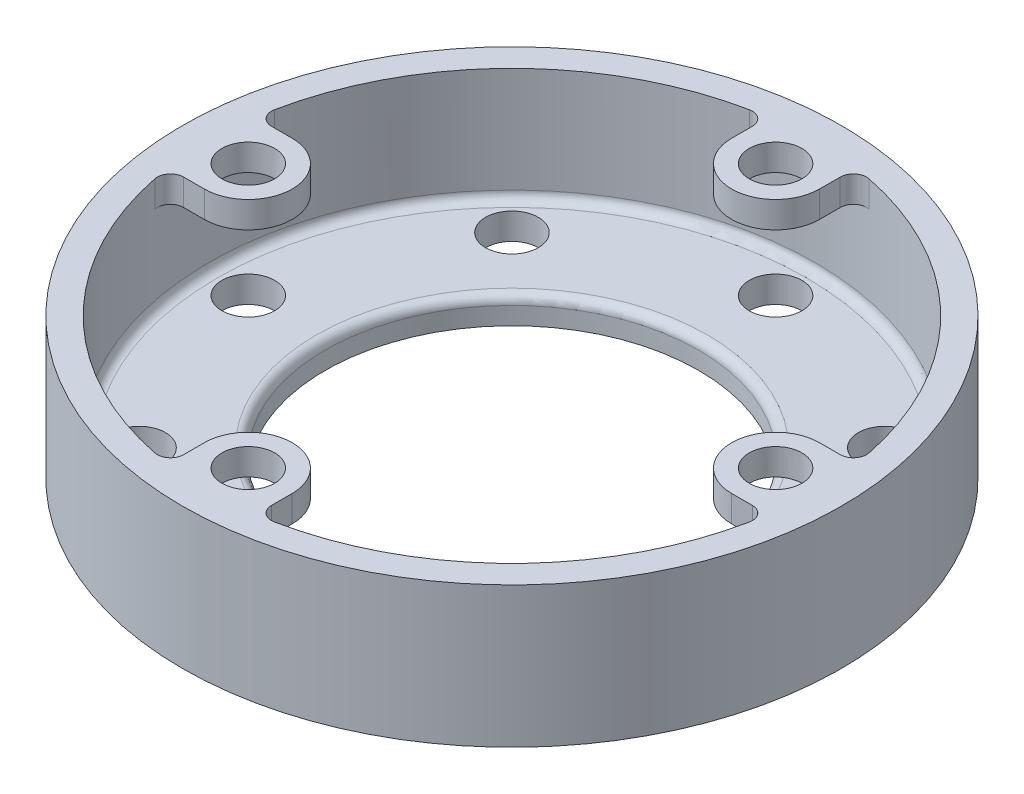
from build123d import *

# Parameters (mm, degrees)
SKETCH1_R                = 75
BASE_EXTRUDE_DEPTH       = 32
SHELL1_T                 = -6
SKETCH4_R                = 42.5
CUT_EXTRUDE2_DEPTH       = 110.206226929
BOSS_EXTRUDE1_START      = -6
BOSS_EXTRUDE1_DEPTH      = 6
CUT_EXTRUDE1_REACH       = 112.788
SKETCH3_R                = 6
FILLET1_R                = 3
CIRPATTERN1_COUNT        = 4
FILLET1_OF_CIRPATTERN1_R = 3
SKETCH5_R                = 6
CUT_EXTRUDE3_DEPTH       = 110.206226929
CIRPATTERN2_COUNT        = 8
FILLET2_R                = 2


with BuildPart() as part:
    # Sketch1 → Base-Extrude (new body)
    with BuildSketch(Plane(origin=(0, 0, 0), x_dir=(1, 0, 0), z_dir=(0, 1, 0))):
        with Locations(Location((0, 0, 0), (0, 0, 270))):
            Circle(SKETCH1_R)
    extrude(amount=BASE_EXTRUDE_DEPTH)

    # Shell1
    shell1_openings = [part.faces().sort_by_distance(p)[0] for p in [
        (0, 32, 0),
    ]]
    offset(amount=SHELL1_T, openings=shell1_openings, kind=Kind.INTERSECTION)

    # Sketch4 → Cut-Extrude2 (cut, through all)
    with BuildSketch(Plane(origin=(0, 6, 0), x_dir=(-1, 0, 0), z_dir=(0, 1, 0))):
        with Locations(Location((0, 0, 0), (0, 0, 90))):
            Circle(SKETCH4_R)
    extrude(amount=-CUT_EXTRUDE2_DEPTH, mode=Mode.SUBTRACT)

    # Sketch2 → Boss-Extrude1 (add)
    with BuildSketch(Plane(origin=(0, 32, 0), x_dir=(-1, 0, 0), z_dir=(0, 1, 0)).offset(BOSS_EXTRUDE1_START)):
        with BuildLine():
            Line((-10, -68.271516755), (-10, -60))
            ThreePointArc((-10, -60), (0, -50), (10, -60))
            Line((10, -60), (10, -68.271516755))
            ThreePointArc((10, -68.271516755), (0, -69), (-10, -68.271516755))
        make_face()
    boss_extrude1 = extrude(amount=BOSS_EXTRUDE1_DEPTH)

    # Sketch3 → Cut-Extrude1 (cut, up to next)
    with BuildSketch(Plane(origin=(0, 32, 0), x_dir=(-1, 0, 0), z_dir=(0, 1, 0)), mode=Mode.PRIVATE) as cut_extrude1_sk1:
        with Locations(Location((0, -60, 0), (0, 0, 90))):
            Circle(SKETCH3_R)
    cut_extrude1_tool1 = extrude(cut_extrude1_sk1.sketch, amount=-CUT_EXTRUDE1_REACH, mode=Mode.PRIVATE) & part.part
    cut_extrude1 = cut_extrude1_tool1.solids().sort_by_distance((0, 32, -60))[0]
    add(cut_extrude1, mode=Mode.SUBTRACT)

    # Fillet1
    fillet1_edges = [part.edges().sort_by_distance(p)[0] for p in [
        (-10, 29, -68.271516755),
        (10, 29, -68.271516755),
    ]]
    fillet(fillet1_edges, radius=FILLET1_R)

    # CirPattern1: Boss-Extrude1, Cut-Extrude1 ×4 about axis
    cirpattern1_axis = Axis((0, 0, 0), (0, 1, 0))
    add([boss_extrude1.rotate(cirpattern1_axis, i * 360 / CIRPATTERN1_COUNT) for i in range(1, CIRPATTERN1_COUNT)])
    add([cut_extrude1.rotate(cirpattern1_axis, i * 360 / CIRPATTERN1_COUNT) for i in range(1, CIRPATTERN1_COUNT)], mode=Mode.SUBTRACT)

    # Fillet1 of CirPattern1
    fillet1_of_cirpattern1_edges = [part.edges().sort_by_distance(p)[0] for p in [
        (-68.271516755, 29, 10),
        (-68.271516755, 29, -10),
        (10, 29, 68.271516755),
        (-10, 29, 68.271516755),
        (68.271516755, 29, -10),
        (68.271516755, 29, 10),
    ]]
    fillet(fillet1_of_cirpattern1_edges, radius=FILLET1_OF_CIRPATTERN1_R)

    # Sketch5 → Cut-Extrude3 (cut, through all)
    with BuildSketch(Plane(origin=(0, 6, 0), x_dir=(-1, 0, 0), z_dir=(0, 1, 0))):
        with Locations(Location((0, -60, 0), (0, 0, 90))):
            Circle(SKETCH5_R)
    cut_extrude3 = extrude(amount=-CUT_EXTRUDE3_DEPTH, mode=Mode.SUBTRACT)

    # CirPattern2: Cut-Extrude3 ×8 about axis
    cirpattern2_axis = Axis((0, 0, 0), (0, 1, 0))
    for i in range(1, CIRPATTERN2_COUNT):
        add(cut_extrude3.rotate(cirpattern2_axis, i * 360 / CIRPATTERN2_COUNT), mode=Mode.SUBTRACT)

    # Fillet2
    fillet2_edges = [part.edges().sort_by_distance(p)[0] for p in [
        (0, 6, -69),
        (0, 6, -42.5),
    ]]
    fillet(fillet2_edges, radius=FILLET2_R)


solid = part.part
